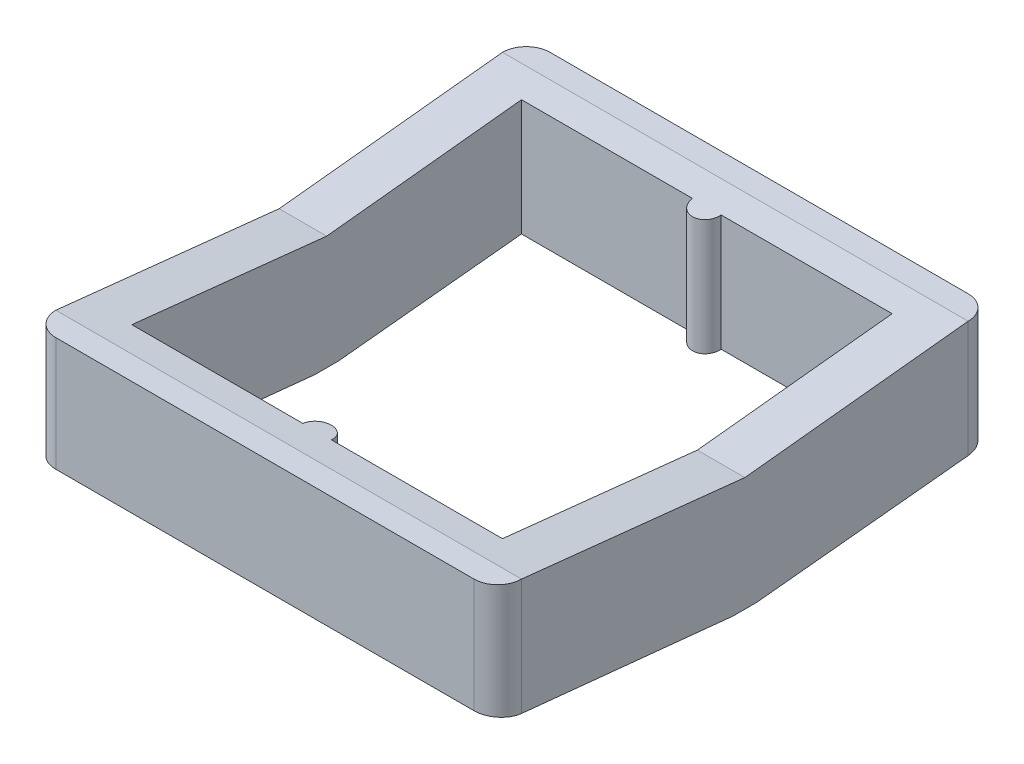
ISO-10303-21;
HEADER;
FILE_DESCRIPTION(('STEP AP214'),'2;1');
FILE_NAME('part.step','',(''),(''),'','','');
FILE_SCHEMA(('AUTOMOTIVE_DESIGN { 1 0 10303 214 1 1 1 1 }'));
ENDSEC;
DATA;
#1=APPLICATION_CONTEXT('core data for automotive mechanical design processes');
#2=APPLICATION_PROTOCOL_DEFINITION('international standard','automotive_design',2000,#1);
#3=PRODUCT_CONTEXT('',#1,'mechanical');
#4=PRODUCT('Part','Part','',(#3));
#5=PRODUCT_RELATED_PRODUCT_CATEGORY('part','',(#4));
#6=PRODUCT_DEFINITION_FORMATION('','',#4);
#7=PRODUCT_DEFINITION_CONTEXT('part definition',#1,'design');
#8=PRODUCT_DEFINITION('design','',#6,#7);
#9=PRODUCT_DEFINITION_SHAPE('','',#8);
#10=(LENGTH_UNIT() NAMED_UNIT(*) SI_UNIT(.MILLI.,.METRE.));
#11=(NAMED_UNIT(*) PLANE_ANGLE_UNIT() SI_UNIT($,.RADIAN.));
#12=(NAMED_UNIT(*) SI_UNIT($,.STERADIAN.) SOLID_ANGLE_UNIT());
#13=UNCERTAINTY_MEASURE_WITH_UNIT(LENGTH_MEASURE(1.E-05),#10,'distance_accuracy_value','');
#14=(GEOMETRIC_REPRESENTATION_CONTEXT(3) GLOBAL_UNCERTAINTY_ASSIGNED_CONTEXT((#13)) GLOBAL_UNIT_ASSIGNED_CONTEXT((#10,
#11,#12)) REPRESENTATION_CONTEXT('',''));
#15=CARTESIAN_POINT('',(0.,0.,0.));
#16=DIRECTION('',(0.,0.,1.));
#17=DIRECTION('',(1.,0.,0.));
#18=AXIS2_PLACEMENT_3D('',#15,#16,#17);
#19=CARTESIAN_POINT('',(-9.8,0.,0.25));
#20=DIRECTION('',(0.,1.,0.));
#21=DIRECTION('',(0.,0.,1.));
#22=AXIS2_PLACEMENT_3D('',#19,#20,#21);
#23=PLANE('',#22);
#24=DIRECTION('',(1.,0.,0.));
#25=VECTOR('',#24,1.);
#26=CARTESIAN_POINT('',(-9.8,0.,-0.25));
#27=LINE('',#26,#25);
#28=CARTESIAN_POINT('',(-9.8,0.,-0.25));
#29=VERTEX_POINT('',#28);
#30=CARTESIAN_POINT('',(-8.8,0.,-0.249999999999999));
#31=VERTEX_POINT('',#30);
#32=EDGE_CURVE('E298',#29,#31,#27,.T.);
#33=ORIENTED_EDGE('',*,*,#32,.T.);
#34=DIRECTION('',(0.,0.,1.));
#35=VECTOR('',#34,1.);
#36=CARTESIAN_POINT('',(-8.8,-1.29236898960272E-13,4.09999999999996));
#37=LINE('',#36,#35);
#38=CARTESIAN_POINT('',(-8.8,0.,0.24999999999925));
#39=VERTEX_POINT('',#38);
#40=EDGE_CURVE('E416',#31,#39,#37,.T.);
#41=ORIENTED_EDGE('',*,*,#40,.T.);
#42=DIRECTION('',(1.,0.,0.));
#43=VECTOR('',#42,1.);
#44=CARTESIAN_POINT('',(-9.8,0.,0.25));
#45=LINE('',#44,#43);
#46=CARTESIAN_POINT('',(-9.8,0.,0.25));
#47=VERTEX_POINT('',#46);
#48=EDGE_CURVE('E294',#47,#39,#45,.T.);
#49=ORIENTED_EDGE('',*,*,#48,.F.);
#50=DIRECTION('',(0.,0.,1.));
#51=VECTOR('',#50,1.);
#52=CARTESIAN_POINT('',(-9.8,0.,0.25));
#53=LINE('',#52,#51);
#54=EDGE_CURVE('E252',#29,#47,#53,.T.);
#55=ORIENTED_EDGE('',*,*,#54,.F.);
#56=EDGE_LOOP('',(#33,#41,#49,#55));
#57=FACE_BOUND('',#56,.T.);
#58=ADVANCED_FACE('F35',(#57),#23,.F.);
#59=CARTESIAN_POINT('',(-9.8,0.,-0.25));
#60=DIRECTION('',(0.,0.994937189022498,0.100498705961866));
#61=DIRECTION('',(0.,-0.100498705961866,0.994937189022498));
#62=AXIS2_PLACEMENT_3D('',#59,#60,#61);
#63=PLANE('',#62);
#64=DIRECTION('',(0.,-0.100498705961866,0.994937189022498));
#65=VECTOR('',#64,1.);
#66=CARTESIAN_POINT('',(-9.8,0.,-0.25));
#67=LINE('',#66,#65);
#68=CARTESIAN_POINT('',(-9.8,0.449494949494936,-4.69999999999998));
#69=VERTEX_POINT('',#68);
#70=EDGE_CURVE('E250',#69,#29,#67,.T.);
#71=ORIENTED_EDGE('',*,*,#70,.F.);
#72=CARTESIAN_POINT('',(-9.3,0.449494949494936,-4.69999999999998));
#73=DIRECTION('',(0.,0.994937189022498,0.100498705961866));
#74=DIRECTION('',(0.,0.100498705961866,-0.994937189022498));
#75=AXIS2_PLACEMENT_3D('',#72,#73,#74);
#76=ELLIPSE('',#75,0.502544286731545,0.5);
#77=CARTESIAN_POINT('',(-9.3,0.499999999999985,-5.19999999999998));
#78=VERTEX_POINT('',#77);
#79=EDGE_CURVE('E325',#69,#78,#76,.F.);
#80=ORIENTED_EDGE('',*,*,#79,.T.);
#81=DIRECTION('',(1.,0.,0.));
#82=VECTOR('',#81,1.);
#83=CARTESIAN_POINT('',(-9.8,0.499999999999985,-5.19999999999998));
#84=LINE('',#83,#82);
#85=CARTESIAN_POINT('',(-0.5,0.499999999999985,-5.19999999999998));
#86=VERTEX_POINT('',#85);
#87=EDGE_CURVE('E263',#78,#86,#84,.T.);
#88=ORIENTED_EDGE('',*,*,#87,.T.);
#89=CARTESIAN_POINT('',(-0.5,0.449494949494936,-4.69999999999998));
#90=DIRECTION('',(0.,0.994937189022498,0.100498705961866));
#91=DIRECTION('',(0.,-0.100498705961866,0.994937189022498));
#92=AXIS2_PLACEMENT_3D('',#89,#90,#91);
#93=ELLIPSE('',#92,0.502544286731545,0.5);
#94=CARTESIAN_POINT('',(0.,0.449494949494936,-4.69999999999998));
#95=VERTEX_POINT('',#94);
#96=EDGE_CURVE('E323',#86,#95,#93,.F.);
#97=ORIENTED_EDGE('',*,*,#96,.T.);
#98=DIRECTION('',(0.,-0.100498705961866,0.994937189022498));
#99=VECTOR('',#98,1.);
#100=CARTESIAN_POINT('',(0.,0.,-0.25));
#101=LINE('',#100,#99);
#102=CARTESIAN_POINT('',(0.,0.,-0.25));
#103=VERTEX_POINT('',#102);
#104=EDGE_CURVE('E249',#95,#103,#101,.T.);
#105=ORIENTED_EDGE('',*,*,#104,.T.);
#106=CARTESIAN_POINT('',(-1.,0.,-0.249999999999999));
#107=VERTEX_POINT('',#106);
#108=EDGE_CURVE('E297',#107,#103,#27,.T.);
#109=ORIENTED_EDGE('',*,*,#108,.F.);
#110=DIRECTION('',(0.,0.100498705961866,-0.994937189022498));
#111=VECTOR('',#110,1.);
#112=CARTESIAN_POINT('',(-1.,0.,-0.25));
#113=LINE('',#112,#111);
#114=CARTESIAN_POINT('',(-1.,0.388888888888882,-4.10000000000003));
#115=VERTEX_POINT('',#114);
#116=EDGE_CURVE('E214',#107,#115,#113,.T.);
#117=ORIENTED_EDGE('',*,*,#116,.T.);
#118=DIRECTION('',(-1.,0.,0.));
#119=VECTOR('',#118,1.);
#120=CARTESIAN_POINT('',(-9.8,0.388888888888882,-4.10000000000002));
#121=LINE('',#120,#119);
#122=CARTESIAN_POINT('',(-4.6,0.388888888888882,-4.10000000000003));
#123=VERTEX_POINT('',#122);
#124=EDGE_CURVE('E223',#115,#123,#121,.T.);
#125=ORIENTED_EDGE('',*,*,#124,.T.);
#126=CARTESIAN_POINT('',(-4.9,0.388888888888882,-4.10000000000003));
#127=DIRECTION('',(0.,0.994937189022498,0.100498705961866));
#128=DIRECTION('',(0.,0.100498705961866,-0.994937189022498));
#129=AXIS2_PLACEMENT_3D('',#126,#127,#128);
#130=ELLIPSE('',#129,0.301526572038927,0.3);
#131=CARTESIAN_POINT('',(-5.2,0.388888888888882,-4.10000000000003));
#132=VERTEX_POINT('',#131);
#133=EDGE_CURVE('E226',#123,#132,#130,.F.);
#134=ORIENTED_EDGE('',*,*,#133,.T.);
#135=DIRECTION('',(-1.,0.,0.));
#136=VECTOR('',#135,1.);
#137=CARTESIAN_POINT('',(-9.8,0.388888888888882,-4.10000000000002));
#138=LINE('',#137,#136);
#139=CARTESIAN_POINT('',(-8.8,0.388888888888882,-4.10000000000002));
#140=VERTEX_POINT('',#139);
#141=EDGE_CURVE('E229',#132,#140,#138,.T.);
#142=ORIENTED_EDGE('',*,*,#141,.T.);
#143=DIRECTION('',(0.,-0.100498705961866,0.994937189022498));
#144=VECTOR('',#143,1.);
#145=CARTESIAN_POINT('',(-8.8,0.,-0.25));
#146=LINE('',#145,#144);
#147=EDGE_CURVE('E238',#140,#31,#146,.T.);
#148=ORIENTED_EDGE('',*,*,#147,.T.);
#149=ORIENTED_EDGE('',*,*,#32,.F.);
#150=EDGE_LOOP('',(#71,#80,#88,#97,#105,#109,#117,#125,#134,#142,#148,#149));
#151=FACE_BOUND('',#150,.T.);
#152=ADVANCED_FACE('F370',(#151),#63,.F.);
#153=CARTESIAN_POINT('',(-1.,0.,0.24999999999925));
#154=VERTEX_POINT('',#153);
#155=CARTESIAN_POINT('',(0.,0.,0.25));
#156=VERTEX_POINT('',#155);
#157=EDGE_CURVE('E293',#154,#156,#45,.T.);
#158=ORIENTED_EDGE('',*,*,#157,.F.);
#159=DIRECTION('',(0.,0.,-1.));
#160=VECTOR('',#159,1.);
#161=CARTESIAN_POINT('',(-1.,-1.29236898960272E-13,4.09999999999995));
#162=LINE('',#161,#160);
#163=EDGE_CURVE('E412',#154,#107,#162,.T.);
#164=ORIENTED_EDGE('',*,*,#163,.T.);
#165=ORIENTED_EDGE('',*,*,#108,.T.);
#166=DIRECTION('',(0.,0.,1.));
#167=VECTOR('',#166,1.);
#168=CARTESIAN_POINT('',(0.,0.,0.25));
#169=LINE('',#168,#167);
#170=EDGE_CURVE('E265',#103,#156,#169,.T.);
#171=ORIENTED_EDGE('',*,*,#170,.T.);
#172=EDGE_LOOP('',(#158,#164,#165,#171));
#173=FACE_BOUND('',#172,.T.);
#174=ADVANCED_FACE('F415',(#173),#23,.F.);
#175=CARTESIAN_POINT('',(-9.8,0.,0.25));
#176=DIRECTION('',(0.,0.994937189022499,-0.100498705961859));
#177=DIRECTION('',(0.,0.100498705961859,0.994937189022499));
#178=AXIS2_PLACEMENT_3D('',#175,#176,#177);
#179=PLANE('',#178);
#180=DIRECTION('',(1.,0.,0.));
#181=VECTOR('',#180,1.);
#182=CARTESIAN_POINT('',(-9.8,0.499999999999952,5.2));
#183=LINE('',#182,#181);
#184=CARTESIAN_POINT('',(-9.3,0.499999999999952,5.2));
#185=VERTEX_POINT('',#184);
#186=CARTESIAN_POINT('',(-0.5,0.499999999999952,5.2));
#187=VERTEX_POINT('',#186);
#188=EDGE_CURVE('E291',#185,#187,#183,.T.);
#189=ORIENTED_EDGE('',*,*,#188,.F.);
#190=CARTESIAN_POINT('',(-9.3,0.449494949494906,4.7));
#191=DIRECTION('',(0.,0.994937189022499,-0.100498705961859));
#192=DIRECTION('',(0.,-0.100498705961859,-0.994937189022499));
#193=AXIS2_PLACEMENT_3D('',#190,#191,#192);
#194=ELLIPSE('',#193,0.502544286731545,0.5);
#195=CARTESIAN_POINT('',(-9.8,0.449494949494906,4.7));
#196=VERTEX_POINT('',#195);
#197=EDGE_CURVE('E346',#185,#196,#194,.F.);
#198=ORIENTED_EDGE('',*,*,#197,.T.);
#199=DIRECTION('',(0.,0.100498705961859,0.994937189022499));
#200=VECTOR('',#199,1.);
#201=CARTESIAN_POINT('',(-9.8,0.,0.25));
#202=LINE('',#201,#200);
#203=EDGE_CURVE('E255',#47,#196,#202,.T.);
#204=ORIENTED_EDGE('',*,*,#203,.F.);
#205=ORIENTED_EDGE('',*,*,#48,.T.);
#206=DIRECTION('',(0.,0.100498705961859,0.994937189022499));
#207=VECTOR('',#206,1.);
#208=CARTESIAN_POINT('',(-8.8,0.,0.25));
#209=LINE('',#208,#207);
#210=CARTESIAN_POINT('',(-8.8,0.388888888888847,4.09999999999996));
#211=VERTEX_POINT('',#210);
#212=EDGE_CURVE('E235',#39,#211,#209,.T.);
#213=ORIENTED_EDGE('',*,*,#212,.T.);
#214=DIRECTION('',(1.,0.,0.));
#215=VECTOR('',#214,1.);
#216=CARTESIAN_POINT('',(-9.8,0.388888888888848,4.09999999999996));
#217=LINE('',#216,#215);
#218=CARTESIAN_POINT('',(-5.2,0.388888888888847,4.09999999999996));
#219=VERTEX_POINT('',#218);
#220=EDGE_CURVE('E243',#211,#219,#217,.T.);
#221=ORIENTED_EDGE('',*,*,#220,.T.);
#222=CARTESIAN_POINT('',(-4.9,0.388888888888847,4.09999999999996));
#223=DIRECTION('',(0.,0.994937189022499,-0.100498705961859));
#224=DIRECTION('',(0.,0.100498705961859,0.994937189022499));
#225=AXIS2_PLACEMENT_3D('',#222,#223,#224);
#226=ELLIPSE('',#225,0.301526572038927,0.3);
#227=CARTESIAN_POINT('',(-4.6,0.388888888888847,4.09999999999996));
#228=VERTEX_POINT('',#227);
#229=EDGE_CURVE('E246',#219,#228,#226,.F.);
#230=ORIENTED_EDGE('',*,*,#229,.T.);
#231=DIRECTION('',(1.,0.,0.));
#232=VECTOR('',#231,1.);
#233=CARTESIAN_POINT('',(-9.8,0.388888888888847,4.09999999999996));
#234=LINE('',#233,#232);
#235=CARTESIAN_POINT('',(-1.,0.388888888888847,4.09999999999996));
#236=VERTEX_POINT('',#235);
#237=EDGE_CURVE('E241',#228,#236,#234,.T.);
#238=ORIENTED_EDGE('',*,*,#237,.T.);
#239=DIRECTION('',(0.,-0.100498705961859,-0.994937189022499));
#240=VECTOR('',#239,1.);
#241=CARTESIAN_POINT('',(-1.,0.,0.25));
#242=LINE('',#241,#240);
#243=EDGE_CURVE('E203',#236,#154,#242,.T.);
#244=ORIENTED_EDGE('',*,*,#243,.T.);
#245=ORIENTED_EDGE('',*,*,#157,.T.);
#246=DIRECTION('',(0.,0.100498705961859,0.994937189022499));
#247=VECTOR('',#246,1.);
#248=CARTESIAN_POINT('',(0.,0.,0.25));
#249=LINE('',#248,#247);
#250=CARTESIAN_POINT('',(0.,0.449494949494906,4.7));
#251=VERTEX_POINT('',#250);
#252=EDGE_CURVE('E268',#156,#251,#249,.T.);
#253=ORIENTED_EDGE('',*,*,#252,.T.);
#254=CARTESIAN_POINT('',(-0.5,0.449494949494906,4.7));
#255=DIRECTION('',(0.,0.994937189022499,-0.100498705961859));
#256=DIRECTION('',(0.,0.100498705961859,0.994937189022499));
#257=AXIS2_PLACEMENT_3D('',#254,#255,#256);
#258=ELLIPSE('',#257,0.502544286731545,0.5);
#259=EDGE_CURVE('E55',#251,#187,#258,.F.);
#260=ORIENTED_EDGE('',*,*,#259,.T.);
#261=EDGE_LOOP('',(#189,#198,#204,#205,#213,#221,#230,#238,#244,#245,#253,#260));
#262=FACE_BOUND('',#261,.T.);
#263=ADVANCED_FACE('F422',(#262),#179,.F.);
#264=CARTESIAN_POINT('',(-9.8,2.89999999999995,5.2));
#265=DIRECTION('',(0.,0.,-1.));
#266=DIRECTION('',(-1.,0.,0.));
#267=AXIS2_PLACEMENT_3D('',#264,#265,#266);
#268=PLANE('',#267);
#269=DIRECTION('',(1.,0.,0.));
#270=VECTOR('',#269,1.);
#271=CARTESIAN_POINT('',(-9.8,2.89999999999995,5.2));
#272=LINE('',#271,#270);
#273=CARTESIAN_POINT('',(-9.3,2.89999999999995,5.2));
#274=VERTEX_POINT('',#273);
#275=CARTESIAN_POINT('',(-0.5,2.89999999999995,5.2));
#276=VERTEX_POINT('',#275);
#277=EDGE_CURVE('E288',#274,#276,#272,.T.);
#278=ORIENTED_EDGE('',*,*,#277,.F.);
#279=DIRECTION('',(0.,1.,0.));
#280=VECTOR('',#279,1.);
#281=CARTESIAN_POINT('',(-9.3,0.499999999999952,5.2));
#282=LINE('',#281,#280);
#283=EDGE_CURVE('E343',#274,#185,#282,.F.);
#284=ORIENTED_EDGE('',*,*,#283,.T.);
#285=ORIENTED_EDGE('',*,*,#188,.T.);
#286=DIRECTION('',(0.,1.,0.));
#287=VECTOR('',#286,1.);
#288=CARTESIAN_POINT('',(-0.5,2.89999999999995,5.2));
#289=LINE('',#288,#287);
#290=EDGE_CURVE('E340',#187,#276,#289,.T.);
#291=ORIENTED_EDGE('',*,*,#290,.T.);
#292=EDGE_LOOP('',(#278,#284,#285,#291));
#293=FACE_BOUND('',#292,.T.);
#294=ADVANCED_FACE('F433',(#293),#268,.F.);
#295=CARTESIAN_POINT('',(-9.8,2.89999999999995,5.2));
#296=DIRECTION('',(0.,-1.,0.));
#297=DIRECTION('',(0.,0.,-1.));
#298=AXIS2_PLACEMENT_3D('',#295,#296,#297);
#299=PLANE('',#298);
#300=DIRECTION('',(1.,0.,0.));
#301=VECTOR('',#300,1.);
#302=CARTESIAN_POINT('',(-9.8,2.89999999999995,4.7));
#303=LINE('',#302,#301);
#304=CARTESIAN_POINT('',(-9.8,2.89999999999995,4.7));
#305=VERTEX_POINT('',#304);
#306=CARTESIAN_POINT('',(0.,2.89999999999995,4.7));
#307=VERTEX_POINT('',#306);
#308=EDGE_CURVE('E285',#305,#307,#303,.T.);
#309=ORIENTED_EDGE('',*,*,#308,.F.);
#310=CARTESIAN_POINT('',(-9.3,2.89999999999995,4.7));
#311=DIRECTION('',(0.,-1.,0.));
#312=DIRECTION('',(0.,0.,-1.));
#313=AXIS2_PLACEMENT_3D('',#310,#311,#312);
#314=CIRCLE('',#313,0.5);
#315=EDGE_CURVE('E338',#305,#274,#314,.F.);
#316=ORIENTED_EDGE('',*,*,#315,.T.);
#317=ORIENTED_EDGE('',*,*,#277,.T.);
#318=CARTESIAN_POINT('',(-0.5,2.89999999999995,4.7));
#319=DIRECTION('',(0.,-1.,0.));
#320=DIRECTION('',(0.,0.,-1.));
#321=AXIS2_PLACEMENT_3D('',#318,#319,#320);
#322=CIRCLE('',#321,0.5);
#323=EDGE_CURVE('E336',#276,#307,#322,.F.);
#324=ORIENTED_EDGE('',*,*,#323,.T.);
#325=EDGE_LOOP('',(#309,#316,#317,#324));
#326=FACE_BOUND('',#325,.T.);
#327=ADVANCED_FACE('F431',(#326),#299,.F.);
#328=CARTESIAN_POINT('',(-9.8,2.39999999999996,0.));
#329=DIRECTION('',(0.,-0.994388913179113,0.10578605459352));
#330=DIRECTION('',(0.,-0.10578605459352,-0.994388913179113));
#331=AXIS2_PLACEMENT_3D('',#328,#329,#330);
#332=PLANE('',#331);
#333=DIRECTION('',(-1.,0.,0.));
#334=VECTOR('',#333,1.);
#335=CARTESIAN_POINT('',(-9.8,2.83617021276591,4.1));
#336=LINE('',#335,#334);
#337=CARTESIAN_POINT('',(-5.2,2.83617021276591,4.09999999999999));
#338=VERTEX_POINT('',#337);
#339=CARTESIAN_POINT('',(-8.8,2.83617021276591,4.09999999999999));
#340=VERTEX_POINT('',#339);
#341=EDGE_CURVE('E315',#338,#340,#336,.T.);
#342=ORIENTED_EDGE('',*,*,#341,.T.);
#343=DIRECTION('',(0.,-0.10578605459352,-0.994388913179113));
#344=VECTOR('',#343,1.);
#345=CARTESIAN_POINT('',(-8.8,2.39999999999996,0.));
#346=LINE('',#345,#344);
#347=CARTESIAN_POINT('',(-8.8,2.39999999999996,0.));
#348=VERTEX_POINT('',#347);
#349=EDGE_CURVE('E232',#340,#348,#346,.T.);
#350=ORIENTED_EDGE('',*,*,#349,.T.);
#351=DIRECTION('',(1.,0.,0.));
#352=VECTOR('',#351,1.);
#353=CARTESIAN_POINT('',(-9.8,2.39999999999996,0.));
#354=LINE('',#353,#352);
#355=CARTESIAN_POINT('',(-9.8,2.39999999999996,0.));
#356=VERTEX_POINT('',#355);
#357=EDGE_CURVE('E282',#356,#348,#354,.T.);
#358=ORIENTED_EDGE('',*,*,#357,.F.);
#359=DIRECTION('',(0.,-0.10578605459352,-0.994388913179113));
#360=VECTOR('',#359,1.);
#361=CARTESIAN_POINT('',(-9.8,2.39999999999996,0.));
#362=LINE('',#361,#360);
#363=EDGE_CURVE('E258',#305,#356,#362,.T.);
#364=ORIENTED_EDGE('',*,*,#363,.F.);
#365=ORIENTED_EDGE('',*,*,#308,.T.);
#366=DIRECTION('',(0.,-0.10578605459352,-0.994388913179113));
#367=VECTOR('',#366,1.);
#368=CARTESIAN_POINT('',(0.,2.39999999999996,0.));
#369=LINE('',#368,#367);
#370=CARTESIAN_POINT('',(0.,2.39999999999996,0.));
#371=VERTEX_POINT('',#370);
#372=EDGE_CURVE('E270',#307,#371,#369,.T.);
#373=ORIENTED_EDGE('',*,*,#372,.T.);
#374=CARTESIAN_POINT('',(-1.,2.39999999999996,0.));
#375=VERTEX_POINT('',#374);
#376=EDGE_CURVE('E211',#375,#371,#354,.T.);
#377=ORIENTED_EDGE('',*,*,#376,.F.);
#378=DIRECTION('',(0.,0.10578605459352,0.994388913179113));
#379=VECTOR('',#378,1.);
#380=CARTESIAN_POINT('',(-1.,2.39999999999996,0.));
#381=LINE('',#380,#379);
#382=CARTESIAN_POINT('',(-1.,2.83617021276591,4.09999999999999));
#383=VERTEX_POINT('',#382);
#384=EDGE_CURVE('E200',#375,#383,#381,.T.);
#385=ORIENTED_EDGE('',*,*,#384,.T.);
#386=DIRECTION('',(-1.,0.,0.));
#387=VECTOR('',#386,1.);
#388=CARTESIAN_POINT('',(-9.8,2.83617021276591,4.09999999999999));
#389=LINE('',#388,#387);
#390=CARTESIAN_POINT('',(-4.6,2.83617021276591,4.09999999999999));
#391=VERTEX_POINT('',#390);
#392=EDGE_CURVE('E185',#383,#391,#389,.T.);
#393=ORIENTED_EDGE('',*,*,#392,.T.);
#394=CARTESIAN_POINT('',(-4.9,2.83617021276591,4.09999999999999));
#395=DIRECTION('',(0.,-0.994388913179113,0.10578605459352));
#396=DIRECTION('',(0.,0.10578605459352,0.994388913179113));
#397=AXIS2_PLACEMENT_3D('',#394,#395,#396);
#398=ELLIPSE('',#397,0.301692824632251,0.3);
#399=EDGE_CURVE('E195',#391,#338,#398,.F.);
#400=ORIENTED_EDGE('',*,*,#399,.T.);
#401=EDGE_LOOP('',(#342,#350,#358,#364,#365,#373,#377,#385,#393,#400));
#402=FACE_BOUND('',#401,.T.);
#403=ADVANCED_FACE('F209',(#402),#332,.F.);
#404=CARTESIAN_POINT('',(-9.8,2.39999999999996,0.));
#405=DIRECTION('',(0.,-0.994388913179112,-0.105786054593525));
#406=DIRECTION('',(0.,0.105786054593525,-0.994388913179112));
#407=AXIS2_PLACEMENT_3D('',#404,#405,#406);
#408=PLANE('',#407);
#409=ORIENTED_EDGE('',*,*,#357,.T.);
#410=DIRECTION('',(0.,0.105786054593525,-0.994388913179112));
#411=VECTOR('',#410,1.);
#412=CARTESIAN_POINT('',(-8.8,2.39999999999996,0.));
#413=LINE('',#412,#411);
#414=CARTESIAN_POINT('',(-8.8,2.83617021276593,-4.09999999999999));
#415=VERTEX_POINT('',#414);
#416=EDGE_CURVE('E196',#348,#415,#413,.T.);
#417=ORIENTED_EDGE('',*,*,#416,.T.);
#418=DIRECTION('',(1.,0.,0.));
#419=VECTOR('',#418,1.);
#420=CARTESIAN_POINT('',(-9.8,2.83617021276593,-4.09999999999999));
#421=LINE('',#420,#419);
#422=CARTESIAN_POINT('',(-5.2,2.83617021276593,-4.09999999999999));
#423=VERTEX_POINT('',#422);
#424=EDGE_CURVE('E309',#415,#423,#421,.T.);
#425=ORIENTED_EDGE('',*,*,#424,.T.);
#426=CARTESIAN_POINT('',(-4.9,2.83617021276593,-4.09999999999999));
#427=DIRECTION('',(0.,-0.994388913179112,-0.105786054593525));
#428=DIRECTION('',(0.,0.105786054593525,-0.994388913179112));
#429=AXIS2_PLACEMENT_3D('',#426,#427,#428);
#430=ELLIPSE('',#429,0.30169282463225,0.3);
#431=CARTESIAN_POINT('',(-4.6,2.83617021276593,-4.09999999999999));
#432=VERTEX_POINT('',#431);
#433=EDGE_CURVE('E306',#423,#432,#430,.F.);
#434=ORIENTED_EDGE('',*,*,#433,.T.);
#435=DIRECTION('',(1.,0.,0.));
#436=VECTOR('',#435,1.);
#437=CARTESIAN_POINT('',(-9.8,2.83617021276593,-4.09999999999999));
#438=LINE('',#437,#436);
#439=CARTESIAN_POINT('',(-1.,2.83617021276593,-4.09999999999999));
#440=VERTEX_POINT('',#439);
#441=EDGE_CURVE('E303',#432,#440,#438,.T.);
#442=ORIENTED_EDGE('',*,*,#441,.T.);
#443=DIRECTION('',(0.,-0.105786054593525,0.994388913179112));
#444=VECTOR('',#443,1.);
#445=CARTESIAN_POINT('',(-1.,2.39999999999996,0.));
#446=LINE('',#445,#444);
#447=EDGE_CURVE('E301',#440,#375,#446,.T.);
#448=ORIENTED_EDGE('',*,*,#447,.T.);
#449=ORIENTED_EDGE('',*,*,#376,.T.);
#450=DIRECTION('',(0.,0.105786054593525,-0.994388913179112));
#451=VECTOR('',#450,1.);
#452=CARTESIAN_POINT('',(0.,2.39999999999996,0.));
#453=LINE('',#452,#451);
#454=CARTESIAN_POINT('',(0.,2.89999999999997,-4.69999999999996));
#455=VERTEX_POINT('',#454);
#456=EDGE_CURVE('E253',#371,#455,#453,.T.);
#457=ORIENTED_EDGE('',*,*,#456,.T.);
#458=DIRECTION('',(1.,0.,0.));
#459=VECTOR('',#458,1.);
#460=CARTESIAN_POINT('',(-9.8,2.89999999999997,-4.69999999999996));
#461=LINE('',#460,#459);
#462=CARTESIAN_POINT('',(-9.8,2.89999999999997,-4.69999999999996));
#463=VERTEX_POINT('',#462);
#464=EDGE_CURVE('E279',#463,#455,#461,.T.);
#465=ORIENTED_EDGE('',*,*,#464,.F.);
#466=DIRECTION('',(0.,0.105786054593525,-0.994388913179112));
#467=VECTOR('',#466,1.);
#468=CARTESIAN_POINT('',(-9.8,2.39999999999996,0.));
#469=LINE('',#468,#467);
#470=EDGE_CURVE('E260',#356,#463,#469,.T.);
#471=ORIENTED_EDGE('',*,*,#470,.F.);
#472=EDGE_LOOP('',(#409,#417,#425,#434,#442,#448,#449,#457,#465,#471));
#473=FACE_BOUND('',#472,.T.);
#474=ADVANCED_FACE('F356',(#473),#408,.F.);
#475=CARTESIAN_POINT('',(-9.8,2.89999999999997,-5.19999999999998));
#476=DIRECTION('',(0.,-1.,0.));
#477=DIRECTION('',(0.,0.,-1.));
#478=AXIS2_PLACEMENT_3D('',#475,#476,#477);
#479=PLANE('',#478);
#480=DIRECTION('',(1.,0.,0.));
#481=VECTOR('',#480,1.);
#482=CARTESIAN_POINT('',(-9.8,2.89999999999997,-5.19999999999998));
#483=LINE('',#482,#481);
#484=CARTESIAN_POINT('',(-9.3,2.89999999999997,-5.19999999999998));
#485=VERTEX_POINT('',#484);
#486=CARTESIAN_POINT('',(-0.5,2.89999999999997,-5.19999999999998));
#487=VERTEX_POINT('',#486);
#488=EDGE_CURVE('E276',#485,#487,#483,.T.);
#489=ORIENTED_EDGE('',*,*,#488,.F.);
#490=CARTESIAN_POINT('',(-9.3,2.89999999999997,-4.69999999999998));
#491=DIRECTION('',(0.,-1.,0.));
#492=DIRECTION('',(0.,0.,-1.));
#493=AXIS2_PLACEMENT_3D('',#490,#491,#492);
#494=CIRCLE('',#493,0.5);
#495=EDGE_CURVE('E334',#485,#463,#494,.F.);
#496=ORIENTED_EDGE('',*,*,#495,.T.);
#497=ORIENTED_EDGE('',*,*,#464,.T.);
#498=CARTESIAN_POINT('',(-0.5,2.89999999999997,-4.69999999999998));
#499=DIRECTION('',(0.,-1.,0.));
#500=DIRECTION('',(0.,0.,-1.));
#501=AXIS2_PLACEMENT_3D('',#498,#499,#500);
#502=CIRCLE('',#501,0.5);
#503=EDGE_CURVE('E332',#455,#487,#502,.F.);
#504=ORIENTED_EDGE('',*,*,#503,.T.);
#505=EDGE_LOOP('',(#489,#496,#497,#504));
#506=FACE_BOUND('',#505,.T.);
#507=ADVANCED_FACE('F361',(#506),#479,.F.);
#508=CARTESIAN_POINT('',(-9.8,2.89999999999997,-5.19999999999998));
#509=DIRECTION('',(0.,0.,1.));
#510=DIRECTION('',(1.,0.,0.));
#511=AXIS2_PLACEMENT_3D('',#508,#509,#510);
#512=PLANE('',#511);
#513=ORIENTED_EDGE('',*,*,#87,.F.);
#514=DIRECTION('',(0.,-1.,0.));
#515=VECTOR('',#514,1.);
#516=CARTESIAN_POINT('',(-9.3,2.89999999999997,-5.19999999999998));
#517=LINE('',#516,#515);
#518=EDGE_CURVE('E330',#78,#485,#517,.F.);
#519=ORIENTED_EDGE('',*,*,#518,.T.);
#520=ORIENTED_EDGE('',*,*,#488,.T.);
#521=DIRECTION('',(0.,-1.,0.));
#522=VECTOR('',#521,1.);
#523=CARTESIAN_POINT('',(-0.5,2.89999999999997,-5.19999999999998));
#524=LINE('',#523,#522);
#525=EDGE_CURVE('E327',#487,#86,#524,.T.);
#526=ORIENTED_EDGE('',*,*,#525,.T.);
#527=EDGE_LOOP('',(#513,#519,#520,#526));
#528=FACE_BOUND('',#527,.T.);
#529=ADVANCED_FACE('F366',(#528),#512,.F.);
#530=CARTESIAN_POINT('',(-9.8,0.499999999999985,-5.19999999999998));
#531=DIRECTION('',(-1.,0.,0.));
#532=DIRECTION('',(0.,0.,1.));
#533=AXIS2_PLACEMENT_3D('',#530,#531,#532);
#534=PLANE('',#533);
#535=ORIENTED_EDGE('',*,*,#470,.T.);
#536=DIRECTION('',(0.,-1.,0.));
#537=VECTOR('',#536,1.);
#538=CARTESIAN_POINT('',(-9.8,0.499999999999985,-4.69999999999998));
#539=LINE('',#538,#537);
#540=EDGE_CURVE('E320',#463,#69,#539,.T.);
#541=ORIENTED_EDGE('',*,*,#540,.T.);
#542=ORIENTED_EDGE('',*,*,#70,.T.);
#543=ORIENTED_EDGE('',*,*,#54,.T.);
#544=ORIENTED_EDGE('',*,*,#203,.T.);
#545=DIRECTION('',(0.,1.,0.));
#546=VECTOR('',#545,1.);
#547=CARTESIAN_POINT('',(-9.8,2.89999999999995,4.7));
#548=LINE('',#547,#546);
#549=EDGE_CURVE('E317',#196,#305,#548,.T.);
#550=ORIENTED_EDGE('',*,*,#549,.T.);
#551=ORIENTED_EDGE('',*,*,#363,.T.);
#552=EDGE_LOOP('',(#535,#541,#542,#543,#544,#550,#551));
#553=FACE_BOUND('',#552,.T.);
#554=ADVANCED_FACE('F375',(#553),#534,.T.);
#555=CARTESIAN_POINT('',(0.,0.499999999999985,-5.19999999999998));
#556=DIRECTION('',(-1.,0.,0.));
#557=DIRECTION('',(0.,0.,1.));
#558=AXIS2_PLACEMENT_3D('',#555,#556,#557);
#559=PLANE('',#558);
#560=ORIENTED_EDGE('',*,*,#372,.F.);
#561=DIRECTION('',(0.,1.,0.));
#562=VECTOR('',#561,1.);
#563=CARTESIAN_POINT('',(0.,0.499999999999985,4.7));
#564=LINE('',#563,#562);
#565=EDGE_CURVE('E11',#307,#251,#564,.F.);
#566=ORIENTED_EDGE('',*,*,#565,.T.);
#567=ORIENTED_EDGE('',*,*,#252,.F.);
#568=ORIENTED_EDGE('',*,*,#170,.F.);
#569=ORIENTED_EDGE('',*,*,#104,.F.);
#570=DIRECTION('',(0.,-1.,0.));
#571=VECTOR('',#570,1.);
#572=CARTESIAN_POINT('',(0.,0.499999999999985,-4.69999999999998));
#573=LINE('',#572,#571);
#574=EDGE_CURVE('E43',#95,#455,#573,.F.);
#575=ORIENTED_EDGE('',*,*,#574,.T.);
#576=ORIENTED_EDGE('',*,*,#456,.F.);
#577=EDGE_LOOP('',(#560,#566,#567,#568,#569,#575,#576));
#578=FACE_BOUND('',#577,.T.);
#579=ADVANCED_FACE('F350',(#578),#559,.F.);
#580=CARTESIAN_POINT('',(-4.9,-1.29236898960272E-13,4.09999999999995));
#581=DIRECTION('',(0.,1.,0.));
#582=DIRECTION('',(0.,0.,1.));
#583=AXIS2_PLACEMENT_3D('',#580,#581,#582);
#584=CYLINDRICAL_SURFACE('',#583,0.3);
#585=DIRECTION('',(0.,1.,0.));
#586=VECTOR('',#585,1.);
#587=CARTESIAN_POINT('',(-5.2,-1.29236898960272E-13,4.09999999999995));
#588=LINE('',#587,#586);
#589=EDGE_CURVE('E212',#219,#338,#588,.T.);
#590=ORIENTED_EDGE('',*,*,#589,.T.);
#591=ORIENTED_EDGE('',*,*,#399,.F.);
#592=DIRECTION('',(0.,1.,0.));
#593=VECTOR('',#592,1.);
#594=CARTESIAN_POINT('',(-4.6,-1.29236898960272E-13,4.09999999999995));
#595=LINE('',#594,#593);
#596=EDGE_CURVE('E191',#228,#391,#595,.T.);
#597=ORIENTED_EDGE('',*,*,#596,.F.);
#598=ORIENTED_EDGE('',*,*,#229,.F.);
#599=EDGE_LOOP('',(#590,#591,#597,#598));
#600=FACE_BOUND('',#599,.T.);
#601=ADVANCED_FACE('F471',(#600),#584,.T.);
#602=CARTESIAN_POINT('',(-5.2,-1.29236898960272E-13,4.09999999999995));
#603=DIRECTION('',(0.,0.,1.));
#604=DIRECTION('',(0.,-1.,0.));
#605=AXIS2_PLACEMENT_3D('',#602,#603,#604);
#606=PLANE('',#605);
#607=DIRECTION('',(0.,1.,0.));
#608=VECTOR('',#607,1.);
#609=CARTESIAN_POINT('',(-8.8,-1.29236898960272E-13,4.09999999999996));
#610=LINE('',#609,#608);
#611=EDGE_CURVE('E217',#211,#340,#610,.T.);
#612=ORIENTED_EDGE('',*,*,#611,.T.);
#613=ORIENTED_EDGE('',*,*,#341,.F.);
#614=ORIENTED_EDGE('',*,*,#589,.F.);
#615=ORIENTED_EDGE('',*,*,#220,.F.);
#616=EDGE_LOOP('',(#612,#613,#614,#615));
#617=FACE_BOUND('',#616,.T.);
#618=ADVANCED_FACE('F385',(#617),#606,.F.);
#619=CARTESIAN_POINT('',(-1.,-1.29236898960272E-13,4.09999999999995));
#620=DIRECTION('',(0.,0.,1.));
#621=DIRECTION('',(0.,-1.,0.));
#622=AXIS2_PLACEMENT_3D('',#619,#620,#621);
#623=PLANE('',#622);
#624=ORIENTED_EDGE('',*,*,#596,.T.);
#625=ORIENTED_EDGE('',*,*,#392,.F.);
#626=DIRECTION('',(0.,1.,0.));
#627=VECTOR('',#626,1.);
#628=CARTESIAN_POINT('',(-1.,-1.29236898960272E-13,4.09999999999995));
#629=LINE('',#628,#627);
#630=EDGE_CURVE('E188',#236,#383,#629,.T.);
#631=ORIENTED_EDGE('',*,*,#630,.F.);
#632=ORIENTED_EDGE('',*,*,#237,.F.);
#633=EDGE_LOOP('',(#624,#625,#631,#632));
#634=FACE_BOUND('',#633,.T.);
#635=ADVANCED_FACE('F187',(#634),#623,.F.);
#636=CARTESIAN_POINT('',(-8.8,-1.29236898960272E-13,4.09999999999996));
#637=DIRECTION('',(-1.,0.,0.));
#638=DIRECTION('',(0.,0.,1.));
#639=AXIS2_PLACEMENT_3D('',#636,#637,#638);
#640=PLANE('',#639);
#641=DIRECTION('',(0.,1.,0.));
#642=VECTOR('',#641,1.);
#643=CARTESIAN_POINT('',(-8.8,0.,-4.10000000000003));
#644=LINE('',#643,#642);
#645=EDGE_CURVE('E387',#140,#415,#644,.T.);
#646=ORIENTED_EDGE('',*,*,#645,.T.);
#647=ORIENTED_EDGE('',*,*,#416,.F.);
#648=ORIENTED_EDGE('',*,*,#349,.F.);
#649=ORIENTED_EDGE('',*,*,#611,.F.);
#650=ORIENTED_EDGE('',*,*,#212,.F.);
#651=ORIENTED_EDGE('',*,*,#40,.F.);
#652=ORIENTED_EDGE('',*,*,#147,.F.);
#653=EDGE_LOOP('',(#646,#647,#648,#649,#650,#651,#652));
#654=FACE_BOUND('',#653,.T.);
#655=ADVANCED_FACE('F383',(#654),#640,.F.);
#656=CARTESIAN_POINT('',(-5.2,0.,-4.10000000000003));
#657=DIRECTION('',(0.,0.,-1.));
#658=DIRECTION('',(0.,1.,0.));
#659=AXIS2_PLACEMENT_3D('',#656,#657,#658);
#660=PLANE('',#659);
#661=DIRECTION('',(0.,1.,0.));
#662=VECTOR('',#661,1.);
#663=CARTESIAN_POINT('',(-5.2,0.,-4.10000000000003));
#664=LINE('',#663,#662);
#665=EDGE_CURVE('E389',#132,#423,#664,.T.);
#666=ORIENTED_EDGE('',*,*,#665,.T.);
#667=ORIENTED_EDGE('',*,*,#424,.F.);
#668=ORIENTED_EDGE('',*,*,#645,.F.);
#669=ORIENTED_EDGE('',*,*,#141,.F.);
#670=EDGE_LOOP('',(#666,#667,#668,#669));
#671=FACE_BOUND('',#670,.T.);
#672=ADVANCED_FACE('F407',(#671),#660,.F.);
#673=CARTESIAN_POINT('',(-4.9,0.,-4.10000000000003));
#674=DIRECTION('',(0.,1.,0.));
#675=DIRECTION('',(0.,0.,1.));
#676=AXIS2_PLACEMENT_3D('',#673,#674,#675);
#677=CYLINDRICAL_SURFACE('',#676,0.3);
#678=DIRECTION('',(0.,1.,0.));
#679=VECTOR('',#678,1.);
#680=CARTESIAN_POINT('',(-4.6,0.,-4.10000000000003));
#681=LINE('',#680,#679);
#682=EDGE_CURVE('E395',#123,#432,#681,.T.);
#683=ORIENTED_EDGE('',*,*,#682,.T.);
#684=ORIENTED_EDGE('',*,*,#433,.F.);
#685=ORIENTED_EDGE('',*,*,#665,.F.);
#686=ORIENTED_EDGE('',*,*,#133,.F.);
#687=EDGE_LOOP('',(#683,#684,#685,#686));
#688=FACE_BOUND('',#687,.T.);
#689=ADVANCED_FACE('F405',(#688),#677,.T.);
#690=CARTESIAN_POINT('',(-1.,0.,-4.10000000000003));
#691=DIRECTION('',(0.,0.,-1.));
#692=DIRECTION('',(0.,1.,0.));
#693=AXIS2_PLACEMENT_3D('',#690,#691,#692);
#694=PLANE('',#693);
#695=DIRECTION('',(0.,1.,0.));
#696=VECTOR('',#695,1.);
#697=CARTESIAN_POINT('',(-1.,0.,-4.10000000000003));
#698=LINE('',#697,#696);
#699=EDGE_CURVE('E205',#115,#440,#698,.T.);
#700=ORIENTED_EDGE('',*,*,#699,.T.);
#701=ORIENTED_EDGE('',*,*,#441,.F.);
#702=ORIENTED_EDGE('',*,*,#682,.F.);
#703=ORIENTED_EDGE('',*,*,#124,.F.);
#704=EDGE_LOOP('',(#700,#701,#702,#703));
#705=FACE_BOUND('',#704,.T.);
#706=ADVANCED_FACE('F401',(#705),#694,.F.);
#707=CARTESIAN_POINT('',(-1.,-1.29236898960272E-13,4.09999999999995));
#708=DIRECTION('',(1.,0.,0.));
#709=DIRECTION('',(0.,0.,-1.));
#710=AXIS2_PLACEMENT_3D('',#707,#708,#709);
#711=PLANE('',#710);
#712=ORIENTED_EDGE('',*,*,#163,.F.);
#713=ORIENTED_EDGE('',*,*,#243,.F.);
#714=ORIENTED_EDGE('',*,*,#630,.T.);
#715=ORIENTED_EDGE('',*,*,#384,.F.);
#716=ORIENTED_EDGE('',*,*,#447,.F.);
#717=ORIENTED_EDGE('',*,*,#699,.F.);
#718=ORIENTED_EDGE('',*,*,#116,.F.);
#719=EDGE_LOOP('',(#712,#713,#714,#715,#716,#717,#718));
#720=FACE_BOUND('',#719,.T.);
#721=ADVANCED_FACE('F199',(#720),#711,.F.);
#722=CARTESIAN_POINT('',(-9.3,0.499999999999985,-4.69999999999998));
#723=DIRECTION('',(0.,1.,0.));
#724=DIRECTION('',(0.,0.,1.));
#725=AXIS2_PLACEMENT_3D('',#722,#723,#724);
#726=CYLINDRICAL_SURFACE('',#725,0.5);
#727=ORIENTED_EDGE('',*,*,#495,.F.);
#728=ORIENTED_EDGE('',*,*,#518,.F.);
#729=ORIENTED_EDGE('',*,*,#79,.F.);
#730=ORIENTED_EDGE('',*,*,#540,.F.);
#731=EDGE_LOOP('',(#727,#728,#729,#730));
#732=FACE_BOUND('',#731,.T.);
#733=ADVANCED_FACE('F373',(#732),#726,.T.);
#734=CARTESIAN_POINT('',(-9.3,0.499999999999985,4.7));
#735=DIRECTION('',(0.,-1.,0.));
#736=DIRECTION('',(0.,0.,-1.));
#737=AXIS2_PLACEMENT_3D('',#734,#735,#736);
#738=CYLINDRICAL_SURFACE('',#737,0.5);
#739=ORIENTED_EDGE('',*,*,#197,.F.);
#740=ORIENTED_EDGE('',*,*,#283,.F.);
#741=ORIENTED_EDGE('',*,*,#315,.F.);
#742=ORIENTED_EDGE('',*,*,#549,.F.);
#743=EDGE_LOOP('',(#739,#740,#741,#742));
#744=FACE_BOUND('',#743,.T.);
#745=ADVANCED_FACE('F427',(#744),#738,.T.);
#746=CARTESIAN_POINT('',(-0.5,2.89999999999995,4.7));
#747=DIRECTION('',(0.,1.,0.));
#748=DIRECTION('',(0.,0.,1.));
#749=AXIS2_PLACEMENT_3D('',#746,#747,#748);
#750=CYLINDRICAL_SURFACE('',#749,0.5);
#751=ORIENTED_EDGE('',*,*,#259,.F.);
#752=ORIENTED_EDGE('',*,*,#565,.F.);
#753=ORIENTED_EDGE('',*,*,#323,.F.);
#754=ORIENTED_EDGE('',*,*,#290,.F.);
#755=EDGE_LOOP('',(#751,#752,#753,#754));
#756=FACE_BOUND('',#755,.T.);
#757=ADVANCED_FACE('F436',(#756),#750,.T.);
#758=CARTESIAN_POINT('',(-0.5,2.89999999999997,-4.69999999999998));
#759=DIRECTION('',(0.,-1.,0.));
#760=DIRECTION('',(0.,0.,-1.));
#761=AXIS2_PLACEMENT_3D('',#758,#759,#760);
#762=CYLINDRICAL_SURFACE('',#761,0.5);
#763=ORIENTED_EDGE('',*,*,#503,.F.);
#764=ORIENTED_EDGE('',*,*,#574,.F.);
#765=ORIENTED_EDGE('',*,*,#96,.F.);
#766=ORIENTED_EDGE('',*,*,#525,.F.);
#767=EDGE_LOOP('',(#763,#764,#765,#766));
#768=FACE_BOUND('',#767,.T.);
#769=ADVANCED_FACE('F37',(#768),#762,.T.);
#770=CLOSED_SHELL('',(#58,#152,#174,#263,#294,#327,#403,#474,#507,#529,#554,#579,#601,#618,#635,
#655,#672,#689,#706,#721,#733,#745,#757,#769));
#771=MANIFOLD_SOLID_BREP('B2',#770);
#772=ADVANCED_BREP_SHAPE_REPRESENTATION('',(#18,#771),#14);
#773=SHAPE_DEFINITION_REPRESENTATION(#9,#772);
ENDSEC;
END-ISO-10303-21;
